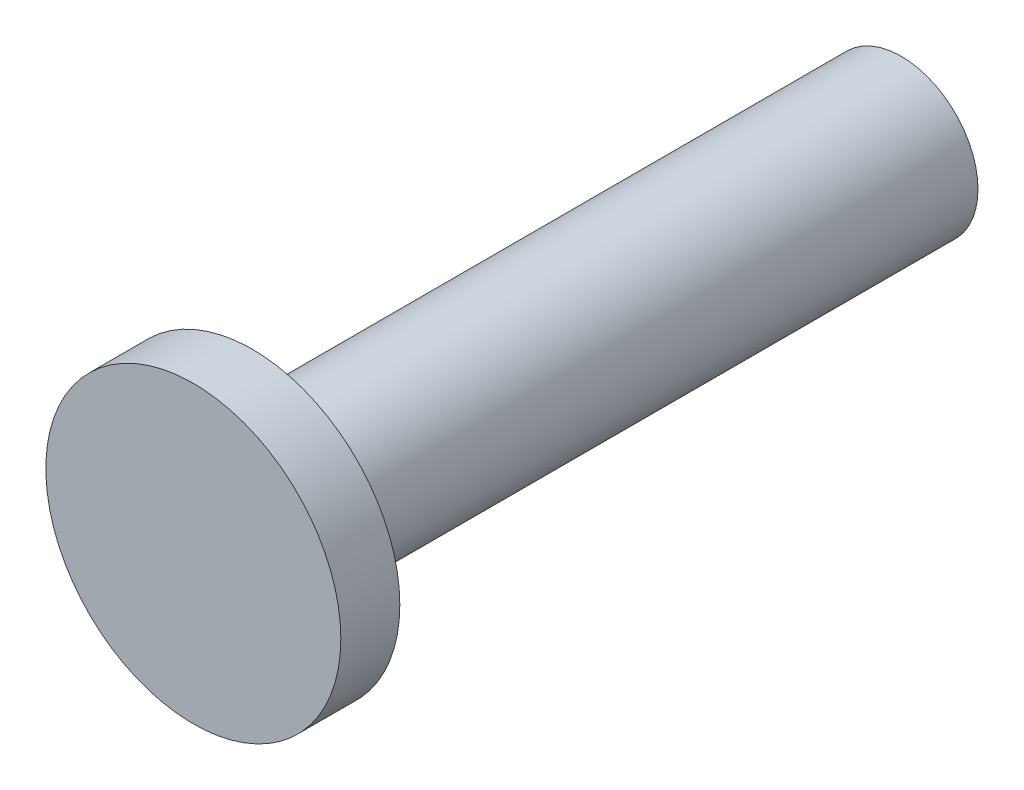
ISO-10303-21;
HEADER;
FILE_DESCRIPTION(('STEP AP214'),'2;1');
FILE_NAME('part.step','',(''),(''),'','','');
FILE_SCHEMA(('AUTOMOTIVE_DESIGN { 1 0 10303 214 1 1 1 1 }'));
ENDSEC;
DATA;
#1=APPLICATION_CONTEXT('core data for automotive mechanical design processes');
#2=APPLICATION_PROTOCOL_DEFINITION('international standard','automotive_design',2000,#1);
#3=PRODUCT_CONTEXT('',#1,'mechanical');
#4=PRODUCT('Part','Part','',(#3));
#5=PRODUCT_RELATED_PRODUCT_CATEGORY('part','',(#4));
#6=PRODUCT_DEFINITION_FORMATION('','',#4);
#7=PRODUCT_DEFINITION_CONTEXT('part definition',#1,'design');
#8=PRODUCT_DEFINITION('design','',#6,#7);
#9=PRODUCT_DEFINITION_SHAPE('','',#8);
#10=(LENGTH_UNIT() NAMED_UNIT(*) SI_UNIT(.MILLI.,.METRE.));
#11=(NAMED_UNIT(*) PLANE_ANGLE_UNIT() SI_UNIT($,.RADIAN.));
#12=(NAMED_UNIT(*) SI_UNIT($,.STERADIAN.) SOLID_ANGLE_UNIT());
#13=UNCERTAINTY_MEASURE_WITH_UNIT(LENGTH_MEASURE(1.E-05),#10,'distance_accuracy_value','');
#14=(GEOMETRIC_REPRESENTATION_CONTEXT(3) GLOBAL_UNCERTAINTY_ASSIGNED_CONTEXT((#13)) GLOBAL_UNIT_ASSIGNED_CONTEXT((#10,
#11,#12)) REPRESENTATION_CONTEXT('',''));
#15=CARTESIAN_POINT('',(0.,0.,0.));
#16=DIRECTION('',(0.,0.,1.));
#17=DIRECTION('',(1.,0.,0.));
#18=AXIS2_PLACEMENT_3D('',#15,#16,#17);
#19=CARTESIAN_POINT('',(-0.9912366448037,4.367245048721,-0.3));
#20=DIRECTION('',(0.,0.,1.));
#21=DIRECTION('',(-1.,0.,0.));
#22=AXIS2_PLACEMENT_3D('',#19,#20,#21);
#23=PLANE('',#22);
#24=CARTESIAN_POINT('',(-1.771236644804,3.586463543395,-0.3));
#25=DIRECTION('',(0.,0.,1.));
#26=DIRECTION('',(1.,0.,0.));
#27=AXIS2_PLACEMENT_3D('',#24,#25,#26);
#28=CIRCLE('',#27,0.75);
#29=CARTESIAN_POINT('',(-1.021236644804,3.586463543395,-0.3));
#30=VERTEX_POINT('',#29);
#31=EDGE_CURVE('E18',#30,#30,#28,.T.);
#32=ORIENTED_EDGE('',*,*,#31,.T.);
#33=EDGE_LOOP('',(#32));
#34=FACE_BOUND('',#33,.T.);
#35=ADVANCED_FACE('F14',(#34),#23,.T.);
#36=CARTESIAN_POINT('',(-1.771236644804,3.586463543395,-0.6));
#37=DIRECTION('',(0.,0.,1.));
#38=DIRECTION('',(1.,0.,0.));
#39=AXIS2_PLACEMENT_3D('',#36,#37,#38);
#40=CYLINDRICAL_SURFACE('',#39,0.75);
#41=CARTESIAN_POINT('',(-1.771236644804,3.586463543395,-0.6));
#42=DIRECTION('',(0.,0.,1.));
#43=DIRECTION('',(1.,0.,0.));
#44=AXIS2_PLACEMENT_3D('',#41,#42,#43);
#45=CIRCLE('',#44,0.75);
#46=CARTESIAN_POINT('',(-1.021236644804,3.586463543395,-0.6));
#47=VERTEX_POINT('',#46);
#48=EDGE_CURVE('E27',#47,#47,#45,.T.);
#49=ORIENTED_EDGE('',*,*,#48,.T.);
#50=EDGE_LOOP('',(#49));
#51=FACE_BOUND('',#50,.T.);
#52=ORIENTED_EDGE('',*,*,#31,.F.);
#53=EDGE_LOOP('',(#52));
#54=FACE_BOUND('',#53,.T.);
#55=ADVANCED_FACE('F36',(#51,#54),#40,.T.);
#56=CARTESIAN_POINT('',(-0.9912366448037,4.367245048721,-0.6));
#57=DIRECTION('',(0.,0.,1.));
#58=DIRECTION('',(-1.,0.,0.));
#59=AXIS2_PLACEMENT_3D('',#56,#57,#58);
#60=PLANE('',#59);
#61=CARTESIAN_POINT('',(-1.771236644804,3.586463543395,-0.6));
#62=DIRECTION('',(0.,0.,1.));
#63=DIRECTION('',(1.,0.,0.));
#64=AXIS2_PLACEMENT_3D('',#61,#62,#63);
#65=CIRCLE('',#64,0.39);
#66=CARTESIAN_POINT('',(-1.381236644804,3.586463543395,-0.6));
#67=VERTEX_POINT('',#66);
#68=EDGE_CURVE('E22',#67,#67,#65,.T.);
#69=ORIENTED_EDGE('',*,*,#68,.T.);
#70=EDGE_LOOP('',(#69));
#71=FACE_BOUND('',#70,.T.);
#72=ORIENTED_EDGE('',*,*,#48,.F.);
#73=EDGE_LOOP('',(#72));
#74=FACE_BOUND('',#73,.T.);
#75=ADVANCED_FACE('F38',(#71,#74),#60,.F.);
#76=CARTESIAN_POINT('',(-1.771236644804,3.586463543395,-3.9));
#77=DIRECTION('',(0.,0.,1.));
#78=DIRECTION('',(1.,0.,0.));
#79=AXIS2_PLACEMENT_3D('',#76,#77,#78);
#80=CYLINDRICAL_SURFACE('',#79,0.39);
#81=ORIENTED_EDGE('',*,*,#68,.F.);
#82=EDGE_LOOP('',(#81));
#83=FACE_BOUND('',#82,.T.);
#84=CARTESIAN_POINT('',(-1.771236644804,3.586463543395,-3.9));
#85=DIRECTION('',(0.,0.,1.));
#86=DIRECTION('',(1.,0.,0.));
#87=AXIS2_PLACEMENT_3D('',#84,#85,#86);
#88=CIRCLE('',#87,0.39);
#89=CARTESIAN_POINT('',(-1.381236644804,3.586463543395,-3.9));
#90=VERTEX_POINT('',#89);
#91=EDGE_CURVE('E10',#90,#90,#88,.T.);
#92=ORIENTED_EDGE('',*,*,#91,.T.);
#93=EDGE_LOOP('',(#92));
#94=FACE_BOUND('',#93,.T.);
#95=ADVANCED_FACE('F45',(#83,#94),#80,.T.);
#96=CARTESIAN_POINT('',(-1.365636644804,3.992063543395,-3.9));
#97=DIRECTION('',(0.,0.,1.));
#98=DIRECTION('',(-1.,0.,0.));
#99=AXIS2_PLACEMENT_3D('',#96,#97,#98);
#100=PLANE('',#99);
#101=ORIENTED_EDGE('',*,*,#91,.F.);
#102=EDGE_LOOP('',(#101));
#103=FACE_BOUND('',#102,.T.);
#104=ADVANCED_FACE('F16',(#103),#100,.F.);
#105=CLOSED_SHELL('',(#35,#55,#75,#95,#104));
#106=MANIFOLD_SOLID_BREP('B1',#105);
#107=ADVANCED_BREP_SHAPE_REPRESENTATION('',(#18,#106),#14);
#108=SHAPE_DEFINITION_REPRESENTATION(#9,#107);
ENDSEC;
END-ISO-10303-21;
